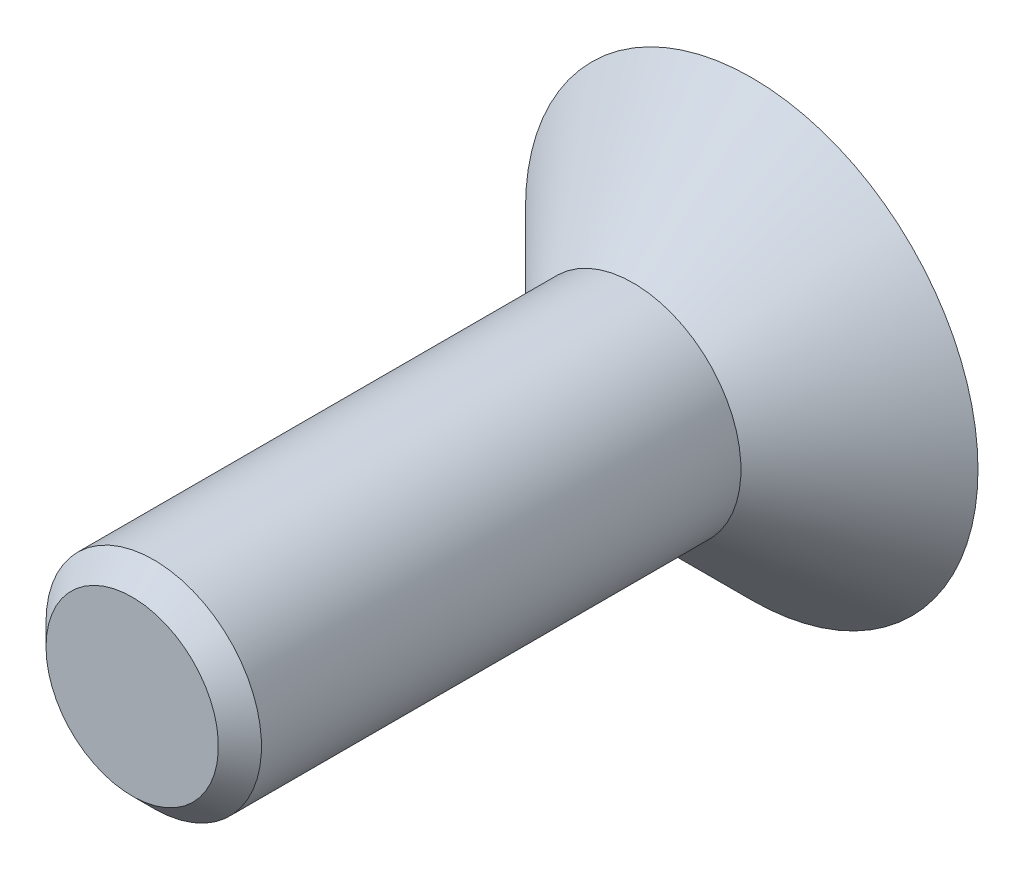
ISO-10303-21;
HEADER;
FILE_DESCRIPTION(('STEP AP214'),'2;1');
FILE_NAME('part.step','',(''),(''),'','','');
FILE_SCHEMA(('AUTOMOTIVE_DESIGN { 1 0 10303 214 1 1 1 1 }'));
ENDSEC;
DATA;
#1=APPLICATION_CONTEXT('core data for automotive mechanical design processes');
#2=APPLICATION_PROTOCOL_DEFINITION('international standard','automotive_design',2000,#1);
#3=PRODUCT_CONTEXT('',#1,'mechanical');
#4=PRODUCT('Part','Part','',(#3));
#5=PRODUCT_RELATED_PRODUCT_CATEGORY('part','',(#4));
#6=PRODUCT_DEFINITION_FORMATION('','',#4);
#7=PRODUCT_DEFINITION_CONTEXT('part definition',#1,'design');
#8=PRODUCT_DEFINITION('design','',#6,#7);
#9=PRODUCT_DEFINITION_SHAPE('','',#8);
#10=(LENGTH_UNIT() NAMED_UNIT(*) SI_UNIT(.MILLI.,.METRE.));
#11=(NAMED_UNIT(*) PLANE_ANGLE_UNIT() SI_UNIT($,.RADIAN.));
#12=(NAMED_UNIT(*) SI_UNIT($,.STERADIAN.) SOLID_ANGLE_UNIT());
#13=UNCERTAINTY_MEASURE_WITH_UNIT(LENGTH_MEASURE(1.E-05),#10,'distance_accuracy_value','');
#14=(GEOMETRIC_REPRESENTATION_CONTEXT(3) GLOBAL_UNCERTAINTY_ASSIGNED_CONTEXT((#13)) GLOBAL_UNIT_ASSIGNED_CONTEXT((#10,
#11,#12)) REPRESENTATION_CONTEXT('',''));
#15=CARTESIAN_POINT('',(0.,0.,0.));
#16=DIRECTION('',(0.,0.,1.));
#17=DIRECTION('',(1.,0.,0.));
#18=AXIS2_PLACEMENT_3D('',#15,#16,#17);
#19=CARTESIAN_POINT('',(0.,0.,-2.19999999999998));
#20=DIRECTION('',(0.,0.,0.999999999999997));
#21=DIRECTION('',(1.,0.,0.));
#22=AXIS2_PLACEMENT_3D('',#19,#20,#21);
#23=PLANE('',#22);
#24=CARTESIAN_POINT('',(0.,0.,-2.19999999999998));
#25=DIRECTION('',(0.,0.,-0.999999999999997));
#26=DIRECTION('',(-1.,0.,0.));
#27=AXIS2_PLACEMENT_3D('',#24,#25,#26);
#28=CIRCLE('',#27,4.2);
#29=CARTESIAN_POINT('',(-4.20000000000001,0.,-2.19999999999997));
#30=VERTEX_POINT('',#29);
#31=EDGE_CURVE('E104',#30,#30,#28,.T.);
#32=ORIENTED_EDGE('',*,*,#31,.T.);
#33=EDGE_LOOP('',(#32));
#34=FACE_BOUND('',#33,.T.);
#35=DIRECTION('',(-0.866025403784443,0.499999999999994,0.));
#36=VECTOR('',#35,1.);
#37=CARTESIAN_POINT('',(0.,1.44337567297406,-2.19999999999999));
#38=LINE('',#37,#36);
#39=CARTESIAN_POINT('',(1.24999999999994,0.72168783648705,-2.19999999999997));
#40=VERTEX_POINT('',#39);
#41=CARTESIAN_POINT('',(0.,1.44337567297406,-2.19999999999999));
#42=VERTEX_POINT('',#41);
#43=EDGE_CURVE('E50',#40,#42,#38,.T.);
#44=ORIENTED_EDGE('',*,*,#43,.T.);
#45=DIRECTION('',(-0.866025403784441,-0.5,0.));
#46=VECTOR('',#45,1.);
#47=CARTESIAN_POINT('',(-1.25000000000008,0.721687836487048,-2.19999999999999));
#48=LINE('',#47,#46);
#49=CARTESIAN_POINT('',(-1.25000000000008,0.721687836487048,-2.19999999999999));
#50=VERTEX_POINT('',#49);
#51=EDGE_CURVE('E90',#42,#50,#48,.T.);
#52=ORIENTED_EDGE('',*,*,#51,.T.);
#53=DIRECTION('',(0.,-0.999999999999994,0.));
#54=VECTOR('',#53,1.);
#55=CARTESIAN_POINT('',(-1.25000000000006,-0.721687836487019,-2.19999999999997));
#56=LINE('',#55,#54);
#57=CARTESIAN_POINT('',(-1.25000000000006,-0.721687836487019,-2.19999999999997));
#58=VERTEX_POINT('',#57);
#59=EDGE_CURVE('E98',#50,#58,#56,.T.);
#60=ORIENTED_EDGE('',*,*,#59,.T.);
#61=DIRECTION('',(0.866025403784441,-0.499999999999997,0.));
#62=VECTOR('',#61,1.);
#63=CARTESIAN_POINT('',(-1.25000000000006,-0.721687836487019,-2.19999999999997));
#64=LINE('',#63,#62);
#65=CARTESIAN_POINT('',(0.,-1.44337567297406,-2.19999999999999));
#66=VERTEX_POINT('',#65);
#67=EDGE_CURVE('E116',#58,#66,#64,.T.);
#68=ORIENTED_EDGE('',*,*,#67,.T.);
#69=DIRECTION('',(0.866025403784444,0.499999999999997,0.));
#70=VECTOR('',#69,1.);
#71=CARTESIAN_POINT('',(0.,-1.44337567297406,-2.19999999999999));
#72=LINE('',#71,#70);
#73=CARTESIAN_POINT('',(1.24999999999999,-0.721687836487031,-2.19999999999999));
#74=VERTEX_POINT('',#73);
#75=EDGE_CURVE('E119',#66,#74,#72,.T.);
#76=ORIENTED_EDGE('',*,*,#75,.T.);
#77=DIRECTION('',(0.,0.999999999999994,0.));
#78=VECTOR('',#77,1.);
#79=CARTESIAN_POINT('',(1.24999999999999,-0.721687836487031,-2.19999999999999));
#80=LINE('',#79,#78);
#81=EDGE_CURVE('E109',#74,#40,#80,.T.);
#82=ORIENTED_EDGE('',*,*,#81,.T.);
#83=EDGE_LOOP('',(#44,#52,#60,#68,#76,#82));
#84=FACE_BOUND('',#83,.T.);
#85=ADVANCED_FACE('F36',(#34,#84),#23,.F.);
#86=CARTESIAN_POINT('',(0.,0.,0.));
#87=DIRECTION('',(0.,0.,-0.999999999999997));
#88=DIRECTION('',(-1.,0.,0.));
#89=AXIS2_PLACEMENT_3D('',#86,#87,#88);
#90=CONICAL_SURFACE('',#89,2.,0.78539816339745);
#91=CARTESIAN_POINT('',(0.,0.,0.));
#92=DIRECTION('',(0.,0.,0.999999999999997));
#93=DIRECTION('',(1.,0.,0.));
#94=AXIS2_PLACEMENT_3D('',#91,#92,#93);
#95=CIRCLE('',#94,2.);
#96=CARTESIAN_POINT('',(-2.00000000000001,0.,0.));
#97=VERTEX_POINT('',#96);
#98=EDGE_CURVE('E110',#97,#97,#95,.T.);
#99=CARTESIAN_POINT('',(-4.20000000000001,0.,-2.19999999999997));
#100=CARTESIAN_POINT('',(-4.17708333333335,0.,-2.17708333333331));
#101=CARTESIAN_POINT('',(-4.15416666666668,0.,-2.15416666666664));
#102=CARTESIAN_POINT('',(-4.10833333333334,0.,-2.10833333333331));
#103=CARTESIAN_POINT('',(-4.08541666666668,0.,-2.08541666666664));
#104=CARTESIAN_POINT('',(-4.03958333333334,0.,-2.03958333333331));
#105=CARTESIAN_POINT('',(-4.01666666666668,0.,-2.01666666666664));
#106=CARTESIAN_POINT('',(-3.97083333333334,0.,-1.97083333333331));
#107=CARTESIAN_POINT('',(-3.94791666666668,0.,-1.94791666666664));
#108=CARTESIAN_POINT('',(-3.90208333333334,0.,-1.90208333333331));
#109=CARTESIAN_POINT('',(-3.87916666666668,0.,-1.87916666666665));
#110=CARTESIAN_POINT('',(-3.83333333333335,0.,-1.83333333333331));
#111=CARTESIAN_POINT('',(-3.81041666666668,0.,-1.81041666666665));
#112=CARTESIAN_POINT('',(-3.76458333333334,0.,-1.76458333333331));
#113=CARTESIAN_POINT('',(-3.74166666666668,0.,-1.74166666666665));
#114=CARTESIAN_POINT('',(-3.69583333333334,0.,-1.69583333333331));
#115=CARTESIAN_POINT('',(-3.67291666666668,0.,-1.67291666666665));
#116=CARTESIAN_POINT('',(-3.62708333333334,0.,-1.62708333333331));
#117=CARTESIAN_POINT('',(-3.60416666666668,0.,-1.60416666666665));
#118=CARTESIAN_POINT('',(-3.55833333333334,0.,-1.55833333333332));
#119=CARTESIAN_POINT('',(-3.53541666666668,0.,-1.53541666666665));
#120=CARTESIAN_POINT('',(-3.48958333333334,0.,-1.48958333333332));
#121=CARTESIAN_POINT('',(-3.46666666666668,0.,-1.46666666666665));
#122=CARTESIAN_POINT('',(-3.42083333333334,0.,-1.42083333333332));
#123=CARTESIAN_POINT('',(-3.39791666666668,0.,-1.39791666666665));
#124=CARTESIAN_POINT('',(-3.35208333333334,0.,-1.35208333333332));
#125=CARTESIAN_POINT('',(-3.32916666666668,0.,-1.32916666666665));
#126=CARTESIAN_POINT('',(-3.28333333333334,0.,-1.28333333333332));
#127=CARTESIAN_POINT('',(-3.26041666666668,0.,-1.26041666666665));
#128=CARTESIAN_POINT('',(-3.21458333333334,0.,-1.21458333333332));
#129=CARTESIAN_POINT('',(-3.19166666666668,0.,-1.19166666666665));
#130=CARTESIAN_POINT('',(-3.14583333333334,0.,-1.14583333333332));
#131=CARTESIAN_POINT('',(-3.12291666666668,0.,-1.12291666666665));
#132=CARTESIAN_POINT('',(-3.07708333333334,0.,-1.07708333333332));
#133=CARTESIAN_POINT('',(-3.05416666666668,0.,-1.05416666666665));
#134=CARTESIAN_POINT('',(-3.00833333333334,0.,-1.00833333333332));
#135=CARTESIAN_POINT('',(-2.98541666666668,0.,-0.985416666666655));
#136=CARTESIAN_POINT('',(-2.93958333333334,0.,-0.939583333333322));
#137=CARTESIAN_POINT('',(-2.91666666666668,0.,-0.916666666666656));
#138=CARTESIAN_POINT('',(-2.87083333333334,0.,-0.870833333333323));
#139=CARTESIAN_POINT('',(-2.84791666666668,0.,-0.847916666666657));
#140=CARTESIAN_POINT('',(-2.80208333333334,0.,-0.802083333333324));
#141=CARTESIAN_POINT('',(-2.77916666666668,0.,-0.779166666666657));
#142=CARTESIAN_POINT('',(-2.73333333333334,0.,-0.733333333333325));
#143=CARTESIAN_POINT('',(-2.71041666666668,0.,-0.710416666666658));
#144=CARTESIAN_POINT('',(-2.66458333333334,0.,-0.664583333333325));
#145=CARTESIAN_POINT('',(-2.64166666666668,0.,-0.641666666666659));
#146=CARTESIAN_POINT('',(-2.59583333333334,0.,-0.595833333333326));
#147=CARTESIAN_POINT('',(-2.57291666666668,0.,-0.57291666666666));
#148=CARTESIAN_POINT('',(-2.52708333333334,0.,-0.527083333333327));
#149=CARTESIAN_POINT('',(-2.50416666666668,0.,-0.50416666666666));
#150=CARTESIAN_POINT('',(-2.45833333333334,0.,-0.458333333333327));
#151=CARTESIAN_POINT('',(-2.43541666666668,0.,-0.435416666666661));
#152=CARTESIAN_POINT('',(-2.38958333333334,0.,-0.389583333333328));
#153=CARTESIAN_POINT('',(-2.36666666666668,0.,-0.366666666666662));
#154=CARTESIAN_POINT('',(-2.32083333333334,0.,-0.320833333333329));
#155=CARTESIAN_POINT('',(-2.29791666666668,0.,-0.297916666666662));
#156=CARTESIAN_POINT('',(-2.25208333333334,0.,-0.25208333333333));
#157=CARTESIAN_POINT('',(-2.22916666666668,0.,-0.229166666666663));
#158=CARTESIAN_POINT('',(-2.18333333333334,0.,-0.183333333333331));
#159=CARTESIAN_POINT('',(-2.16041666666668,0.,-0.160416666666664));
#160=CARTESIAN_POINT('',(-2.11458333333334,0.,-0.114583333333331));
#161=CARTESIAN_POINT('',(-2.09166666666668,0.,-0.0916666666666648));
#162=CARTESIAN_POINT('',(-2.04583333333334,0.,-0.0458333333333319));
#163=CARTESIAN_POINT('',(-2.02291666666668,0.,-0.0229166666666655));
#164=CARTESIAN_POINT('',(-2.00000000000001,0.,0.));
#165=B_SPLINE_CURVE_WITH_KNOTS('',3,(#99,#100,#101,#102,#103,#104,#105,#106,#107,#108,#109,#110,
#111,#112,#113,#114,#115,#116,#117,#118,#119,#120,#121,#122,#123,#124,#125,#126,#127,#128,#129,
#130,#131,#132,#133,#134,#135,#136,#137,#138,#139,#140,#141,#142,#143,#144,#145,#146,#147,#148,
#149,#150,#151,#152,#153,#154,#155,#156,#157,#158,#159,#160,#161,#162,#163,#164),.UNSPECIFIED.,
.F.,.F.,(4,2,2,2,2,2,2,2,2,2,2,2,2,2,2,2,2,2,2,2,2,2,2,2,2,2,2,2,2,2,2,2,4),(0.,
0.0972271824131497,0.1944543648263,0.29168154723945,0.3889087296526,0.486135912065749,
0.583363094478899,0.680590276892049,0.777817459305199,0.875044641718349,0.972271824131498,
1.06949900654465,1.1667261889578,1.26395337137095,1.3611805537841,1.45840773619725,
1.5556349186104,1.65286210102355,1.7500892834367,1.84731646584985,1.944543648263,
2.04177083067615,2.1389980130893,2.23622519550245,2.3334523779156,2.43067956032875,
2.5279067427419,2.62513392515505,2.7223611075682,2.81958828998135,2.91681547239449,
3.01404265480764,3.11126983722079),.UNSPECIFIED.);
#166=EDGE_CURVE('BSEAM159',#30,#97,#165,.T.);
#167=ORIENTED_EDGE('',*,*,#31,.F.);
#168=ORIENTED_EDGE('',*,*,#98,.F.);
#169=ORIENTED_EDGE('',*,*,#166,.T.);
#170=ORIENTED_EDGE('',*,*,#166,.F.);
#171=EDGE_LOOP('',(#167,#169,#168,#170));
#172=FACE_BOUND('',#171,.T.);
#173=ADVANCED_FACE('F159',(#172),#90,.T.);
#174=CARTESIAN_POINT('',(0.,1.44337567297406,-0.19999999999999));
#175=DIRECTION('',(-0.500000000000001,-0.866025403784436,0.));
#176=DIRECTION('',(0.866025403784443,-0.499999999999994,0.));
#177=AXIS2_PLACEMENT_3D('',#174,#175,#176);
#178=PLANE('',#177);
#179=ORIENTED_EDGE('',*,*,#43,.F.);
#180=DIRECTION('',(0.,0.,-0.999999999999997));
#181=VECTOR('',#180,1.);
#182=CARTESIAN_POINT('',(1.24999999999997,0.721687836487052,-0.199999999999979));
#183=LINE('',#182,#181);
#184=CARTESIAN_POINT('',(1.24999999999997,0.721687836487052,-0.199999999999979));
#185=VERTEX_POINT('',#184);
#186=EDGE_CURVE('E132',#185,#40,#183,.T.);
#187=ORIENTED_EDGE('',*,*,#186,.F.);
#188=DIRECTION('',(-0.866025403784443,0.499999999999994,0.));
#189=VECTOR('',#188,1.);
#190=CARTESIAN_POINT('',(0.,1.44337567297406,-0.19999999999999));
#191=LINE('',#190,#189);
#192=CARTESIAN_POINT('',(0.,1.44337567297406,-0.19999999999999));
#193=VERTEX_POINT('',#192);
#194=EDGE_CURVE('E103',#185,#193,#191,.T.);
#195=ORIENTED_EDGE('',*,*,#194,.T.);
#196=DIRECTION('',(0.,0.,-0.999999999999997));
#197=VECTOR('',#196,1.);
#198=CARTESIAN_POINT('',(0.,1.44337567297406,-0.19999999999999));
#199=LINE('',#198,#197);
#200=EDGE_CURVE('E92',#193,#42,#199,.T.);
#201=ORIENTED_EDGE('',*,*,#200,.T.);
#202=EDGE_LOOP('',(#179,#187,#195,#201));
#203=FACE_BOUND('',#202,.T.);
#204=ADVANCED_FACE('F101',(#203),#178,.T.);
#205=CARTESIAN_POINT('',(-1.25000000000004,0.721687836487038,-0.200000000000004));
#206=DIRECTION('',(0.500000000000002,-0.866025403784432,0.));
#207=DIRECTION('',(0.866025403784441,0.5,0.));
#208=AXIS2_PLACEMENT_3D('',#205,#206,#207);
#209=PLANE('',#208);
#210=ORIENTED_EDGE('',*,*,#51,.F.);
#211=ORIENTED_EDGE('',*,*,#200,.F.);
#212=DIRECTION('',(-0.866025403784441,-0.5,0.));
#213=VECTOR('',#212,1.);
#214=CARTESIAN_POINT('',(-1.25000000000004,0.721687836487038,-0.200000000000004));
#215=LINE('',#214,#213);
#216=CARTESIAN_POINT('',(-1.25000000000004,0.721687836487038,-0.200000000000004));
#217=VERTEX_POINT('',#216);
#218=EDGE_CURVE('E123',#193,#217,#215,.T.);
#219=ORIENTED_EDGE('',*,*,#218,.T.);
#220=DIRECTION('',(0.,0.,-0.999999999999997));
#221=VECTOR('',#220,1.);
#222=CARTESIAN_POINT('',(-1.25000000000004,0.721687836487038,-0.200000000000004));
#223=LINE('',#222,#221);
#224=EDGE_CURVE('E94',#217,#50,#223,.T.);
#225=ORIENTED_EDGE('',*,*,#224,.T.);
#226=EDGE_LOOP('',(#210,#211,#219,#225));
#227=FACE_BOUND('',#226,.T.);
#228=ADVANCED_FACE('F91',(#227),#209,.T.);
#229=CARTESIAN_POINT('',(-1.25000000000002,-0.721687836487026,-0.199999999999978));
#230=DIRECTION('',(1.,0.,0.));
#231=DIRECTION('',(0.,0.,-0.999999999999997));
#232=AXIS2_PLACEMENT_3D('',#229,#230,#231);
#233=PLANE('',#232);
#234=ORIENTED_EDGE('',*,*,#59,.F.);
#235=ORIENTED_EDGE('',*,*,#224,.F.);
#236=DIRECTION('',(0.,-0.999999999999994,0.));
#237=VECTOR('',#236,1.);
#238=CARTESIAN_POINT('',(-1.25000000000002,-0.721687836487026,-0.199999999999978));
#239=LINE('',#238,#237);
#240=CARTESIAN_POINT('',(-1.25000000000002,-0.721687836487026,-0.199999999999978));
#241=VERTEX_POINT('',#240);
#242=EDGE_CURVE('E125',#217,#241,#239,.T.);
#243=ORIENTED_EDGE('',*,*,#242,.T.);
#244=DIRECTION('',(0.,0.,-0.999999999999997));
#245=VECTOR('',#244,1.);
#246=CARTESIAN_POINT('',(-1.25000000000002,-0.721687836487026,-0.199999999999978));
#247=LINE('',#246,#245);
#248=EDGE_CURVE('E138',#241,#58,#247,.T.);
#249=ORIENTED_EDGE('',*,*,#248,.T.);
#250=EDGE_LOOP('',(#234,#235,#243,#249));
#251=FACE_BOUND('',#250,.T.);
#252=ADVANCED_FACE('F176',(#251),#233,.T.);
#253=CARTESIAN_POINT('',(-1.25000000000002,-0.721687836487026,-0.199999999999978));
#254=DIRECTION('',(0.500000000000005,0.866025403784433,0.));
#255=DIRECTION('',(-0.866025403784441,0.499999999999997,0.));
#256=AXIS2_PLACEMENT_3D('',#253,#254,#255);
#257=PLANE('',#256);
#258=ORIENTED_EDGE('',*,*,#67,.F.);
#259=ORIENTED_EDGE('',*,*,#248,.F.);
#260=DIRECTION('',(0.866025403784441,-0.499999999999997,0.));
#261=VECTOR('',#260,1.);
#262=CARTESIAN_POINT('',(-1.25000000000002,-0.721687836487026,-0.199999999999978));
#263=LINE('',#262,#261);
#264=CARTESIAN_POINT('',(0.,-1.44337567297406,-0.199999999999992));
#265=VERTEX_POINT('',#264);
#266=EDGE_CURVE('E127',#241,#265,#263,.T.);
#267=ORIENTED_EDGE('',*,*,#266,.T.);
#268=DIRECTION('',(0.,0.,-0.999999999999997));
#269=VECTOR('',#268,1.);
#270=CARTESIAN_POINT('',(0.,-1.44337567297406,-0.199999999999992));
#271=LINE('',#270,#269);
#272=EDGE_CURVE('E136',#265,#66,#271,.T.);
#273=ORIENTED_EDGE('',*,*,#272,.T.);
#274=EDGE_LOOP('',(#258,#259,#267,#273));
#275=FACE_BOUND('',#274,.T.);
#276=ADVANCED_FACE('F179',(#275),#257,.T.);
#277=CARTESIAN_POINT('',(0.,-1.44337567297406,-0.199999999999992));
#278=DIRECTION('',(-0.499999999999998,0.866025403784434,0.));
#279=DIRECTION('',(-0.866025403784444,-0.499999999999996,0.));
#280=AXIS2_PLACEMENT_3D('',#277,#278,#279);
#281=PLANE('',#280);
#282=ORIENTED_EDGE('',*,*,#75,.F.);
#283=ORIENTED_EDGE('',*,*,#272,.F.);
#284=DIRECTION('',(0.866025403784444,0.499999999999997,0.));
#285=VECTOR('',#284,1.);
#286=CARTESIAN_POINT('',(0.,-1.44337567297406,-0.199999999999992));
#287=LINE('',#286,#285);
#288=CARTESIAN_POINT('',(1.25,-0.721687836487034,-0.199999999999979));
#289=VERTEX_POINT('',#288);
#290=EDGE_CURVE('E129',#265,#289,#287,.T.);
#291=ORIENTED_EDGE('',*,*,#290,.T.);
#292=DIRECTION('',(0.,0.,-0.999999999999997));
#293=VECTOR('',#292,1.);
#294=CARTESIAN_POINT('',(1.25,-0.721687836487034,-0.199999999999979));
#295=LINE('',#294,#293);
#296=EDGE_CURVE('E134',#289,#74,#295,.T.);
#297=ORIENTED_EDGE('',*,*,#296,.T.);
#298=EDGE_LOOP('',(#282,#283,#291,#297));
#299=FACE_BOUND('',#298,.T.);
#300=ADVANCED_FACE('F183',(#299),#281,.T.);
#301=CARTESIAN_POINT('',(1.25,-0.721687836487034,-0.199999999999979));
#302=DIRECTION('',(-1.,0.,0.));
#303=DIRECTION('',(0.,0.,0.999999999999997));
#304=AXIS2_PLACEMENT_3D('',#301,#302,#303);
#305=PLANE('',#304);
#306=ORIENTED_EDGE('',*,*,#81,.F.);
#307=ORIENTED_EDGE('',*,*,#296,.F.);
#308=DIRECTION('',(0.,0.999999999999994,0.));
#309=VECTOR('',#308,1.);
#310=CARTESIAN_POINT('',(1.25,-0.721687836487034,-0.199999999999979));
#311=LINE('',#310,#309);
#312=EDGE_CURVE('E57',#289,#185,#311,.T.);
#313=ORIENTED_EDGE('',*,*,#312,.T.);
#314=ORIENTED_EDGE('',*,*,#186,.T.);
#315=EDGE_LOOP('',(#306,#307,#313,#314));
#316=FACE_BOUND('',#315,.T.);
#317=ADVANCED_FACE('F187',(#316),#305,.T.);
#318=CARTESIAN_POINT('',(1.24999999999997,0.721687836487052,-0.199999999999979));
#319=DIRECTION('',(0.,0.,0.999999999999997));
#320=DIRECTION('',(1.,0.,0.));
#321=AXIS2_PLACEMENT_3D('',#318,#319,#320);
#322=PLANE('',#321);
#323=ORIENTED_EDGE('',*,*,#194,.F.);
#324=ORIENTED_EDGE('',*,*,#312,.F.);
#325=ORIENTED_EDGE('',*,*,#290,.F.);
#326=ORIENTED_EDGE('',*,*,#266,.F.);
#327=ORIENTED_EDGE('',*,*,#242,.F.);
#328=ORIENTED_EDGE('',*,*,#218,.F.);
#329=EDGE_LOOP('',(#323,#324,#325,#326,#327,#328));
#330=FACE_BOUND('',#329,.T.);
#331=ADVANCED_FACE('F191',(#330),#322,.F.);
#332=CARTESIAN_POINT('',(0.,0.,9.29999999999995));
#333=DIRECTION('',(0.,0.,0.999999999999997));
#334=DIRECTION('',(1.,0.,0.));
#335=AXIS2_PLACEMENT_3D('',#332,#333,#334);
#336=PLANE('',#335);
#337=CARTESIAN_POINT('',(0.,0.,9.29999999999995));
#338=DIRECTION('',(0.,0.,0.999999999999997));
#339=DIRECTION('',(1.,0.,0.));
#340=AXIS2_PLACEMENT_3D('',#337,#338,#339);
#341=CIRCLE('',#340,1.6);
#342=CARTESIAN_POINT('',(-1.60000000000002,0.,9.29999999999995));
#343=VERTEX_POINT('',#342);
#344=EDGE_CURVE('E43',#343,#343,#341,.T.);
#345=ORIENTED_EDGE('',*,*,#344,.T.);
#346=EDGE_LOOP('',(#345));
#347=FACE_BOUND('',#346,.T.);
#348=ADVANCED_FACE('F145',(#347),#336,.T.);
#349=CARTESIAN_POINT('',(0.,0.,0.));
#350=DIRECTION('',(0.,0.,0.999999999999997));
#351=DIRECTION('',(1.,0.,0.));
#352=AXIS2_PLACEMENT_3D('',#349,#350,#351);
#353=CYLINDRICAL_SURFACE('',#352,2.);
#354=CARTESIAN_POINT('',(0.,0.,8.89999999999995));
#355=DIRECTION('',(0.,0.,0.999999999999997));
#356=DIRECTION('',(1.,0.,0.));
#357=AXIS2_PLACEMENT_3D('',#354,#355,#356);
#358=CIRCLE('',#357,2.);
#359=CARTESIAN_POINT('',(-2.00000000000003,0.,8.89999999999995));
#360=VERTEX_POINT('',#359);
#361=EDGE_CURVE('E13',#360,#360,#358,.F.);
#362=ORIENTED_EDGE('',*,*,#361,.T.);
#363=EDGE_LOOP('',(#362));
#364=FACE_BOUND('',#363,.T.);
#365=ORIENTED_EDGE('',*,*,#98,.T.);
#366=EDGE_LOOP('',(#365));
#367=FACE_BOUND('',#366,.T.);
#368=ADVANCED_FACE('F149',(#364,#367),#353,.T.);
#369=CARTESIAN_POINT('',(0.,0.,9.29999999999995));
#370=DIRECTION('',(0.,0.,-0.999999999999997));
#371=DIRECTION('',(-1.,0.,0.));
#372=AXIS2_PLACEMENT_3D('',#369,#370,#371);
#373=CONICAL_SURFACE('',#372,1.6,0.785398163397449);
#374=CARTESIAN_POINT('',(-2.00000000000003,0.,8.89999999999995));
#375=CARTESIAN_POINT('',(-1.99583333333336,0.,8.90416666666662));
#376=CARTESIAN_POINT('',(-1.99166666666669,0.,8.90833333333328));
#377=CARTESIAN_POINT('',(-1.98333333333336,0.,8.91666666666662));
#378=CARTESIAN_POINT('',(-1.97916666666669,0.,8.92083333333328));
#379=CARTESIAN_POINT('',(-1.97083333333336,0.,8.92916666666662));
#380=CARTESIAN_POINT('',(-1.96666666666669,0.,8.93333333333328));
#381=CARTESIAN_POINT('',(-1.95833333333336,0.,8.94166666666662));
#382=CARTESIAN_POINT('',(-1.95416666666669,0.,8.94583333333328));
#383=CARTESIAN_POINT('',(-1.94583333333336,0.,8.95416666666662));
#384=CARTESIAN_POINT('',(-1.94166666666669,0.,8.95833333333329));
#385=CARTESIAN_POINT('',(-1.93333333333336,0.,8.96666666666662));
#386=CARTESIAN_POINT('',(-1.92916666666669,0.,8.97083333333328));
#387=CARTESIAN_POINT('',(-1.92083333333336,0.,8.97916666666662));
#388=CARTESIAN_POINT('',(-1.91666666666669,0.,8.98333333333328));
#389=CARTESIAN_POINT('',(-1.90833333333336,0.,8.99166666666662));
#390=CARTESIAN_POINT('',(-1.90416666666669,0.,8.99583333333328));
#391=CARTESIAN_POINT('',(-1.89583333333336,0.,9.00416666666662));
#392=CARTESIAN_POINT('',(-1.89166666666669,0.,9.00833333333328));
#393=CARTESIAN_POINT('',(-1.88333333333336,0.,9.01666666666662));
#394=CARTESIAN_POINT('',(-1.87916666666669,0.,9.02083333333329));
#395=CARTESIAN_POINT('',(-1.87083333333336,0.,9.02916666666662));
#396=CARTESIAN_POINT('',(-1.86666666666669,0.,9.03333333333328));
#397=CARTESIAN_POINT('',(-1.85833333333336,0.,9.04166666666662));
#398=CARTESIAN_POINT('',(-1.85416666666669,0.,9.04583333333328));
#399=CARTESIAN_POINT('',(-1.84583333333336,0.,9.05416666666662));
#400=CARTESIAN_POINT('',(-1.84166666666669,0.,9.05833333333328));
#401=CARTESIAN_POINT('',(-1.83333333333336,0.,9.06666666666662));
#402=CARTESIAN_POINT('',(-1.82916666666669,0.,9.07083333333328));
#403=CARTESIAN_POINT('',(-1.82083333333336,0.,9.07916666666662));
#404=CARTESIAN_POINT('',(-1.81666666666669,0.,9.08333333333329));
#405=CARTESIAN_POINT('',(-1.80833333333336,0.,9.09166666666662));
#406=CARTESIAN_POINT('',(-1.80416666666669,0.,9.09583333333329));
#407=CARTESIAN_POINT('',(-1.79583333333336,0.,9.10416666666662));
#408=CARTESIAN_POINT('',(-1.79166666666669,0.,9.10833333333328));
#409=CARTESIAN_POINT('',(-1.78333333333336,0.,9.11666666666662));
#410=CARTESIAN_POINT('',(-1.77916666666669,0.,9.12083333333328));
#411=CARTESIAN_POINT('',(-1.77083333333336,0.,9.12916666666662));
#412=CARTESIAN_POINT('',(-1.76666666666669,0.,9.13333333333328));
#413=CARTESIAN_POINT('',(-1.75833333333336,0.,9.14166666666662));
#414=CARTESIAN_POINT('',(-1.75416666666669,0.,9.14583333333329));
#415=CARTESIAN_POINT('',(-1.74583333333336,0.,9.15416666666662));
#416=CARTESIAN_POINT('',(-1.74166666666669,0.,9.15833333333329));
#417=CARTESIAN_POINT('',(-1.73333333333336,0.,9.16666666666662));
#418=CARTESIAN_POINT('',(-1.72916666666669,0.,9.17083333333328));
#419=CARTESIAN_POINT('',(-1.72083333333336,0.,9.17916666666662));
#420=CARTESIAN_POINT('',(-1.71666666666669,0.,9.18333333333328));
#421=CARTESIAN_POINT('',(-1.70833333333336,0.,9.19166666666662));
#422=CARTESIAN_POINT('',(-1.70416666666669,0.,9.19583333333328));
#423=CARTESIAN_POINT('',(-1.69583333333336,0.,9.20416666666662));
#424=CARTESIAN_POINT('',(-1.69166666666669,0.,9.20833333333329));
#425=CARTESIAN_POINT('',(-1.68333333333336,0.,9.21666666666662));
#426=CARTESIAN_POINT('',(-1.67916666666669,0.,9.22083333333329));
#427=CARTESIAN_POINT('',(-1.67083333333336,0.,9.22916666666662));
#428=CARTESIAN_POINT('',(-1.66666666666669,0.,9.23333333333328));
#429=CARTESIAN_POINT('',(-1.65833333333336,0.,9.24166666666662));
#430=CARTESIAN_POINT('',(-1.65416666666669,0.,9.24583333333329));
#431=CARTESIAN_POINT('',(-1.64583333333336,0.,9.25416666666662));
#432=CARTESIAN_POINT('',(-1.64166666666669,0.,9.25833333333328));
#433=CARTESIAN_POINT('',(-1.63333333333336,0.,9.26666666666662));
#434=CARTESIAN_POINT('',(-1.62916666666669,0.,9.27083333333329));
#435=CARTESIAN_POINT('',(-1.62083333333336,0.,9.27916666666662));
#436=CARTESIAN_POINT('',(-1.61666666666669,0.,9.28333333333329));
#437=CARTESIAN_POINT('',(-1.60833333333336,0.,9.29166666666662));
#438=CARTESIAN_POINT('',(-1.60416666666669,0.,9.29583333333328));
#439=CARTESIAN_POINT('',(-1.60000000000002,0.,9.29999999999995));
#440=B_SPLINE_CURVE_WITH_KNOTS('',3,(#374,#375,#376,#377,#378,#379,#380,#381,#382,#383,#384,
#385,#386,#387,#388,#389,#390,#391,#392,#393,#394,#395,#396,#397,#398,#399,#400,#401,#402,#403,
#404,#405,#406,#407,#408,#409,#410,#411,#412,#413,#414,#415,#416,#417,#418,#419,#420,#421,#422,
#423,#424,#425,#426,#427,#428,#429,#430,#431,#432,#433,#434,#435,#436,#437,#438,#439),
.UNSPECIFIED.,.F.,.F.,(4,2,2,2,2,2,2,2,2,2,2,2,2,2,2,2,2,2,2,2,2,2,2,2,2,2,2,2,2,2,2,2,4),(0.,
0.0176776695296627,0.0353553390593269,0.0530330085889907,0.0707106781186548,0.0883883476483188,
0.106066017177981,0.123743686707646,0.14142135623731,0.159099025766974,0.176776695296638,
0.194454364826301,0.212132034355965,0.229809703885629,0.247487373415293,0.265165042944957,
0.282842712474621,0.300520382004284,0.318198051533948,0.335875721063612,0.353553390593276,
0.37123106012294,0.388908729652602,0.406586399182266,0.424264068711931,0.441941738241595,
0.459619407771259,0.477297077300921,0.494974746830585,0.512652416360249,0.530330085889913,
0.548007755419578,0.56568542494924),.UNSPECIFIED.);
#441=EDGE_CURVE('BSEAM147',#360,#343,#440,.T.);
#442=ORIENTED_EDGE('',*,*,#361,.F.);
#443=ORIENTED_EDGE('',*,*,#344,.F.);
#444=ORIENTED_EDGE('',*,*,#441,.T.);
#445=ORIENTED_EDGE('',*,*,#441,.F.);
#446=EDGE_LOOP('',(#442,#444,#443,#445));
#447=FACE_BOUND('',#446,.T.);
#448=ADVANCED_FACE('F147',(#447),#373,.T.);
#449=CLOSED_SHELL('',(#85,#173,#204,#228,#252,#276,#300,#317,#331,#348,#368,#448));
#450=MANIFOLD_SOLID_BREP('B2',#449);
#451=ADVANCED_BREP_SHAPE_REPRESENTATION('',(#18,#450),#14);
#452=SHAPE_DEFINITION_REPRESENTATION(#9,#451);
ENDSEC;
END-ISO-10303-21;
